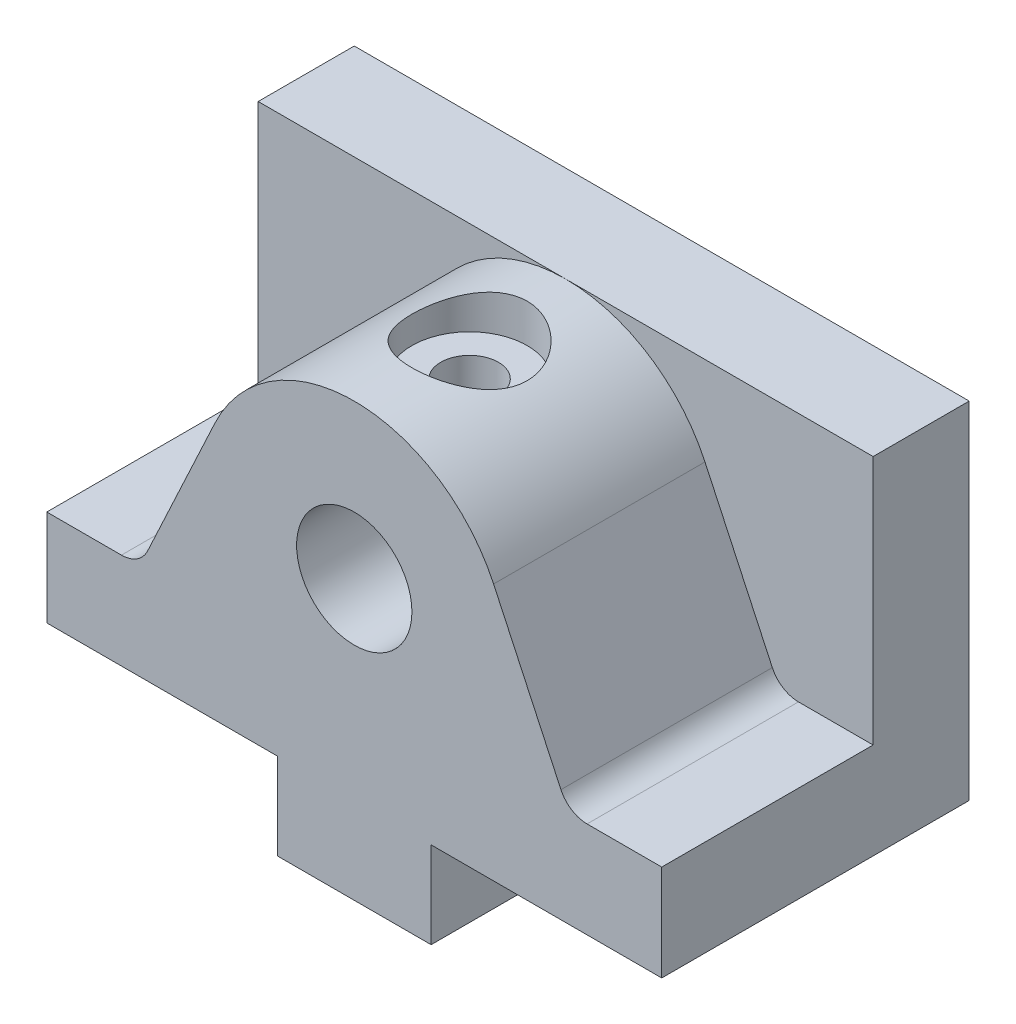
from build123d import *

# Parameters (mm, degrees)
BOSS_EXTRUDE1_DEPTH       = 22
BOSS_EXTRUDE2_DEPTH       = 10
FILLET1_R                 = 3
SKETCH3_R                 = 6
CUT_EXTRUDE1_DEPTH        = 24
M6X1_0_TAPPED_HOLE1_D     = 6
M6X1_0_TAPPED_HOLE1_DEPTH = 17
M6X1_0_TAPPED_HOLE1_TIP   = 1.802581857
HOLE1_D                   = 6
HOLE1_DEPTH               = 15.999
HOLE1_CBORE_D             = 12
HOLE1_CBORE_DEPTH         = 4
HOLE1_TIP                 = 1.802581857


with BuildPart() as part:
    # Sketch1 → Boss-Extrude1 (new body)
    with BuildSketch(Plane.XY):
        with BuildLine():
            Line((-32, 0), (-8, 0))
            Line((-8, 0), (-8, -9))
            Line((-8, -9), (8, -9))
            Line((8, -9), (8, 0))
            Line((8, 0), (32, 0))
            Line((32, 0), (32, 10))
            Line((32, 10), (22.317123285, 10))
            Line((22.317123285, 10), (14.500924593, 26.761892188))
            ThreePointArc((14.500924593, 26.761892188), (0, 36), (-14.500924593, 26.761892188))
            Line((-14.500924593, 26.761892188), (-22.317123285, 10))
            Line((-22.317123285, 10), (-32, 10))
            Line((-32, 10), (-32, 0))
        make_face()
    extrude(amount=BOSS_EXTRUDE1_DEPTH)

    # Sketch2 → Boss-Extrude2 (add)
    with BuildSketch(Plane(origin=(0, 0, 0), x_dir=(-1, 0, 0), z_dir=(0, 0, -1))):
        Polygon((-32, 0), (-32, 10), (-32, 36), (32, 36), (32, 10), (32, 0), (8, 0), (8, -9), (-8, -9), (-8, 0), align=None)
    extrude(amount=BOSS_EXTRUDE2_DEPTH)

    # Fillet1
    fillet1_edges = [part.edges().sort_by_distance(p)[0] for p in [
        (-22.317123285, 10, 11),
        (22.317123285, 10, 11),
    ]]
    fillet(fillet1_edges, radius=FILLET1_R)

    # Sketch3 → Cut-Extrude1 (cut)
    with BuildSketch(Plane.XY.offset(22)):
        with Locations((0, 20)):
            Circle(SKETCH3_R)
    extrude(amount=-CUT_EXTRUDE1_DEPTH, mode=Mode.SUBTRACT)

    # M6x1.0 Tapped Hole1
    with Locations(Plane.XZ.offset(9)):
        with Locations((0, 14), (0, -2)):
            Hole(M6X1_0_TAPPED_HOLE1_D / 2, depth=M6X1_0_TAPPED_HOLE1_DEPTH)
            with Locations((0, 0, -(M6X1_0_TAPPED_HOLE1_DEPTH + M6X1_0_TAPPED_HOLE1_TIP / 2))):  # 118° drill point
                Cone(0, M6X1_0_TAPPED_HOLE1_D / 2, M6X1_0_TAPPED_HOLE1_TIP, mode=Mode.SUBTRACT)

    # Hole1
    with Locations(Plane(origin=(0, 36, 0), x_dir=(-1, 0, 0), z_dir=(0, 1, 0))):
        with Locations((0, 10)):
            CounterBoreHole(HOLE1_D / 2, HOLE1_CBORE_D / 2, HOLE1_CBORE_DEPTH, depth=HOLE1_DEPTH)
            with Locations((0, 0, -(HOLE1_DEPTH + HOLE1_TIP / 2))):  # 118° drill point
                Cone(0, HOLE1_D / 2, HOLE1_TIP, mode=Mode.SUBTRACT)


solid = part.part
